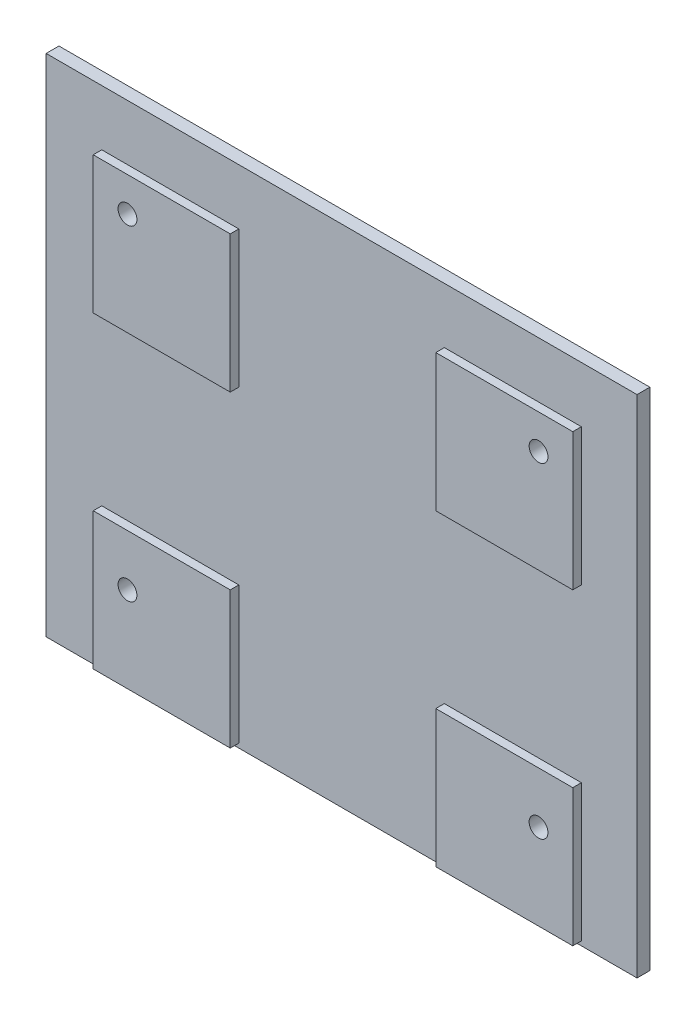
ISO-10303-21;
HEADER;
FILE_DESCRIPTION(('STEP AP214'),'2;1');
FILE_NAME('part.step','',(''),(''),'','','');
FILE_SCHEMA(('AUTOMOTIVE_DESIGN { 1 0 10303 214 1 1 1 1 }'));
ENDSEC;
DATA;
#1=APPLICATION_CONTEXT('core data for automotive mechanical design processes');
#2=APPLICATION_PROTOCOL_DEFINITION('international standard','automotive_design',2000,#1);
#3=PRODUCT_CONTEXT('',#1,'mechanical');
#4=PRODUCT('Part','Part','',(#3));
#5=PRODUCT_RELATED_PRODUCT_CATEGORY('part','',(#4));
#6=PRODUCT_DEFINITION_FORMATION('','',#4);
#7=PRODUCT_DEFINITION_CONTEXT('part definition',#1,'design');
#8=PRODUCT_DEFINITION('design','',#6,#7);
#9=PRODUCT_DEFINITION_SHAPE('','',#8);
#10=(LENGTH_UNIT() NAMED_UNIT(*) SI_UNIT(.MILLI.,.METRE.));
#11=(NAMED_UNIT(*) PLANE_ANGLE_UNIT() SI_UNIT($,.RADIAN.));
#12=(NAMED_UNIT(*) SI_UNIT($,.STERADIAN.) SOLID_ANGLE_UNIT());
#13=UNCERTAINTY_MEASURE_WITH_UNIT(LENGTH_MEASURE(1.E-05),#10,'distance_accuracy_value','');
#14=(GEOMETRIC_REPRESENTATION_CONTEXT(3) GLOBAL_UNCERTAINTY_ASSIGNED_CONTEXT((#13)) GLOBAL_UNIT_ASSIGNED_CONTEXT((#10,
#11,#12)) REPRESENTATION_CONTEXT('',''));
#15=CARTESIAN_POINT('',(0.,0.,0.));
#16=DIRECTION('',(0.,0.,1.));
#17=DIRECTION('',(1.,0.,0.));
#18=AXIS2_PLACEMENT_3D('',#15,#16,#17);
#19=CARTESIAN_POINT('',(345.,-295.000000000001,15.));
#20=DIRECTION('',(0.,0.,-1.));
#21=DIRECTION('',(-1.,0.,0.));
#22=AXIS2_PLACEMENT_3D('',#19,#20,#21);
#23=PLANE('',#22);
#24=DIRECTION('',(0.,-1.,0.));
#25=VECTOR('',#24,1.);
#26=CARTESIAN_POINT('',(120.,70.,15.));
#27=LINE('',#26,#25);
#28=CARTESIAN_POINT('',(120.,230.,15.));
#29=VERTEX_POINT('',#28);
#30=CARTESIAN_POINT('',(120.,70.,15.));
#31=VERTEX_POINT('',#30);
#32=EDGE_CURVE('E193',#29,#31,#27,.T.);
#33=ORIENTED_EDGE('',*,*,#32,.F.);
#34=DIRECTION('',(-1.,0.,0.));
#35=VECTOR('',#34,1.);
#36=CARTESIAN_POINT('',(120.,230.,15.));
#37=LINE('',#36,#35);
#38=CARTESIAN_POINT('',(280.,230.,15.));
#39=VERTEX_POINT('',#38);
#40=EDGE_CURVE('E206',#39,#29,#37,.T.);
#41=ORIENTED_EDGE('',*,*,#40,.F.);
#42=DIRECTION('',(0.,1.,0.));
#43=VECTOR('',#42,1.);
#44=CARTESIAN_POINT('',(280.,70.,15.));
#45=LINE('',#44,#43);
#46=CARTESIAN_POINT('',(280.,70.,15.));
#47=VERTEX_POINT('',#46);
#48=EDGE_CURVE('E215',#47,#39,#45,.T.);
#49=ORIENTED_EDGE('',*,*,#48,.F.);
#50=DIRECTION('',(1.,0.,0.));
#51=VECTOR('',#50,1.);
#52=CARTESIAN_POINT('',(120.,70.,15.));
#53=LINE('',#52,#51);
#54=EDGE_CURVE('E196',#31,#47,#53,.T.);
#55=ORIENTED_EDGE('',*,*,#54,.F.);
#56=EDGE_LOOP('',(#33,#41,#49,#55));
#57=FACE_BOUND('',#56,.T.);
#58=DIRECTION('',(0.,-1.,0.));
#59=VECTOR('',#58,1.);
#60=CARTESIAN_POINT('',(-280.,-290.,15.));
#61=LINE('',#60,#59);
#62=CARTESIAN_POINT('',(-280.,-130.,15.));
#63=VERTEX_POINT('',#62);
#64=CARTESIAN_POINT('',(-280.,-290.,15.));
#65=VERTEX_POINT('',#64);
#66=EDGE_CURVE('E264',#63,#65,#61,.T.);
#67=ORIENTED_EDGE('',*,*,#66,.F.);
#68=DIRECTION('',(-1.,0.,0.));
#69=VECTOR('',#68,1.);
#70=CARTESIAN_POINT('',(-280.,-130.,15.));
#71=LINE('',#70,#69);
#72=CARTESIAN_POINT('',(-120.,-130.,15.));
#73=VERTEX_POINT('',#72);
#74=EDGE_CURVE('E269',#73,#63,#71,.T.);
#75=ORIENTED_EDGE('',*,*,#74,.F.);
#76=DIRECTION('',(0.,1.,0.));
#77=VECTOR('',#76,1.);
#78=CARTESIAN_POINT('',(-120.,-290.,15.));
#79=LINE('',#78,#77);
#80=CARTESIAN_POINT('',(-120.,-290.,15.));
#81=VERTEX_POINT('',#80);
#82=EDGE_CURVE('E281',#81,#73,#79,.T.);
#83=ORIENTED_EDGE('',*,*,#82,.F.);
#84=DIRECTION('',(1.,0.,0.));
#85=VECTOR('',#84,1.);
#86=CARTESIAN_POINT('',(-280.,-290.,15.));
#87=LINE('',#86,#85);
#88=EDGE_CURVE('E278',#65,#81,#87,.T.);
#89=ORIENTED_EDGE('',*,*,#88,.F.);
#90=EDGE_LOOP('',(#67,#75,#83,#89));
#91=FACE_BOUND('',#90,.T.);
#92=DIRECTION('',(0.,1.,0.));
#93=VECTOR('',#92,1.);
#94=CARTESIAN_POINT('',(345.,295.000000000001,15.));
#95=LINE('',#94,#93);
#96=CARTESIAN_POINT('',(345.,-295.000000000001,15.));
#97=VERTEX_POINT('',#96);
#98=CARTESIAN_POINT('',(345.,295.000000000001,15.));
#99=VERTEX_POINT('',#98);
#100=EDGE_CURVE('E298',#97,#99,#95,.T.);
#101=ORIENTED_EDGE('',*,*,#100,.T.);
#102=DIRECTION('',(-1.,0.,0.));
#103=VECTOR('',#102,1.);
#104=CARTESIAN_POINT('',(-345.,295.000000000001,15.));
#105=LINE('',#104,#103);
#106=CARTESIAN_POINT('',(-345.,295.000000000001,15.));
#107=VERTEX_POINT('',#106);
#108=EDGE_CURVE('E301',#99,#107,#105,.T.);
#109=ORIENTED_EDGE('',*,*,#108,.T.);
#110=DIRECTION('',(0.,-1.,0.));
#111=VECTOR('',#110,1.);
#112=CARTESIAN_POINT('',(-345.,-295.000000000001,15.));
#113=LINE('',#112,#111);
#114=CARTESIAN_POINT('',(-345.,-295.000000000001,15.));
#115=VERTEX_POINT('',#114);
#116=EDGE_CURVE('E304',#107,#115,#113,.T.);
#117=ORIENTED_EDGE('',*,*,#116,.T.);
#118=DIRECTION('',(1.,0.,0.));
#119=VECTOR('',#118,1.);
#120=CARTESIAN_POINT('',(345.,-295.000000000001,15.));
#121=LINE('',#120,#119);
#122=EDGE_CURVE('E306',#115,#97,#121,.T.);
#123=ORIENTED_EDGE('',*,*,#122,.T.);
#124=EDGE_LOOP('',(#101,#109,#117,#123));
#125=FACE_BOUND('',#124,.T.);
#126=DIRECTION('',(0.,-1.,0.));
#127=VECTOR('',#126,1.);
#128=CARTESIAN_POINT('',(120.,-290.,15.));
#129=LINE('',#128,#127);
#130=CARTESIAN_POINT('',(120.,-130.,15.));
#131=VERTEX_POINT('',#130);
#132=CARTESIAN_POINT('',(120.,-290.,15.));
#133=VERTEX_POINT('',#132);
#134=EDGE_CURVE('E231',#131,#133,#129,.T.);
#135=ORIENTED_EDGE('',*,*,#134,.F.);
#136=DIRECTION('',(-1.,0.,0.));
#137=VECTOR('',#136,1.);
#138=CARTESIAN_POINT('',(120.,-130.,15.));
#139=LINE('',#138,#137);
#140=CARTESIAN_POINT('',(280.,-130.,15.));
#141=VERTEX_POINT('',#140);
#142=EDGE_CURVE('E236',#141,#131,#139,.T.);
#143=ORIENTED_EDGE('',*,*,#142,.F.);
#144=DIRECTION('',(0.,1.,0.));
#145=VECTOR('',#144,1.);
#146=CARTESIAN_POINT('',(280.,-290.,15.));
#147=LINE('',#146,#145);
#148=CARTESIAN_POINT('',(280.,-290.,15.));
#149=VERTEX_POINT('',#148);
#150=EDGE_CURVE('E248',#149,#141,#147,.T.);
#151=ORIENTED_EDGE('',*,*,#150,.F.);
#152=DIRECTION('',(1.,0.,0.));
#153=VECTOR('',#152,1.);
#154=CARTESIAN_POINT('',(120.,-290.,15.));
#155=LINE('',#154,#153);
#156=EDGE_CURVE('E245',#133,#149,#155,.T.);
#157=ORIENTED_EDGE('',*,*,#156,.F.);
#158=EDGE_LOOP('',(#135,#143,#151,#157));
#159=FACE_BOUND('',#158,.T.);
#160=DIRECTION('',(0.,-1.,0.));
#161=VECTOR('',#160,1.);
#162=CARTESIAN_POINT('',(-280.,69.9999999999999,15.));
#163=LINE('',#162,#161);
#164=CARTESIAN_POINT('',(-280.,230.,15.));
#165=VERTEX_POINT('',#164);
#166=CARTESIAN_POINT('',(-280.,70.,15.));
#167=VERTEX_POINT('',#166);
#168=EDGE_CURVE('E192',#165,#167,#163,.T.);
#169=ORIENTED_EDGE('',*,*,#168,.F.);
#170=DIRECTION('',(-1.,0.,0.));
#171=VECTOR('',#170,1.);
#172=CARTESIAN_POINT('',(-280.,230.,15.));
#173=LINE('',#172,#171);
#174=CARTESIAN_POINT('',(-120.,230.,15.));
#175=VERTEX_POINT('',#174);
#176=EDGE_CURVE('E189',#175,#165,#173,.T.);
#177=ORIENTED_EDGE('',*,*,#176,.F.);
#178=DIRECTION('',(0.,1.,0.));
#179=VECTOR('',#178,1.);
#180=CARTESIAN_POINT('',(-120.,69.9999999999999,15.));
#181=LINE('',#180,#179);
#182=CARTESIAN_POINT('',(-120.,69.9999999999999,15.));
#183=VERTEX_POINT('',#182);
#184=EDGE_CURVE('E55',#183,#175,#181,.T.);
#185=ORIENTED_EDGE('',*,*,#184,.F.);
#186=DIRECTION('',(1.,0.,0.));
#187=VECTOR('',#186,1.);
#188=CARTESIAN_POINT('',(-280.,69.9999999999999,15.));
#189=LINE('',#188,#187);
#190=EDGE_CURVE('E50',#167,#183,#189,.T.);
#191=ORIENTED_EDGE('',*,*,#190,.F.);
#192=EDGE_LOOP('',(#169,#177,#185,#191));
#193=FACE_BOUND('',#192,.T.);
#194=ADVANCED_FACE('F35',(#57,#91,#125,#159,#193),#23,.F.);
#195=CARTESIAN_POINT('',(345.,295.000000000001,15.));
#196=DIRECTION('',(-1.,0.,0.));
#197=DIRECTION('',(0.,-1.,0.));
#198=AXIS2_PLACEMENT_3D('',#195,#196,#197);
#199=PLANE('',#198);
#200=DIRECTION('',(0.,1.,0.));
#201=VECTOR('',#200,1.);
#202=CARTESIAN_POINT('',(345.,295.000000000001,0.));
#203=LINE('',#202,#201);
#204=CARTESIAN_POINT('',(345.,-295.000000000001,0.));
#205=VERTEX_POINT('',#204);
#206=CARTESIAN_POINT('',(345.,295.000000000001,0.));
#207=VERTEX_POINT('',#206);
#208=EDGE_CURVE('E297',#205,#207,#203,.T.);
#209=ORIENTED_EDGE('',*,*,#208,.T.);
#210=DIRECTION('',(0.,0.,-1.));
#211=VECTOR('',#210,1.);
#212=CARTESIAN_POINT('',(345.,295.000000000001,15.));
#213=LINE('',#212,#211);
#214=EDGE_CURVE('E11',#99,#207,#213,.T.);
#215=ORIENTED_EDGE('',*,*,#214,.F.);
#216=ORIENTED_EDGE('',*,*,#100,.F.);
#217=DIRECTION('',(0.,0.,-1.));
#218=VECTOR('',#217,1.);
#219=CARTESIAN_POINT('',(345.,-295.000000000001,15.));
#220=LINE('',#219,#218);
#221=EDGE_CURVE('E308',#97,#205,#220,.T.);
#222=ORIENTED_EDGE('',*,*,#221,.T.);
#223=EDGE_LOOP('',(#209,#215,#216,#222));
#224=FACE_BOUND('',#223,.T.);
#225=ADVANCED_FACE('F37',(#224),#199,.F.);
#226=CARTESIAN_POINT('',(-345.,295.000000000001,15.));
#227=DIRECTION('',(0.,-1.,0.));
#228=DIRECTION('',(0.,0.,-1.));
#229=AXIS2_PLACEMENT_3D('',#226,#227,#228);
#230=PLANE('',#229);
#231=DIRECTION('',(-1.,0.,0.));
#232=VECTOR('',#231,1.);
#233=CARTESIAN_POINT('',(-345.,295.000000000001,0.));
#234=LINE('',#233,#232);
#235=CARTESIAN_POINT('',(-345.,295.000000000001,0.));
#236=VERTEX_POINT('',#235);
#237=EDGE_CURVE('E311',#207,#236,#234,.T.);
#238=ORIENTED_EDGE('',*,*,#237,.T.);
#239=DIRECTION('',(0.,0.,-1.));
#240=VECTOR('',#239,1.);
#241=CARTESIAN_POINT('',(-345.,295.000000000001,15.));
#242=LINE('',#241,#240);
#243=EDGE_CURVE('E43',#107,#236,#242,.T.);
#244=ORIENTED_EDGE('',*,*,#243,.F.);
#245=ORIENTED_EDGE('',*,*,#108,.F.);
#246=ORIENTED_EDGE('',*,*,#214,.T.);
#247=EDGE_LOOP('',(#238,#244,#245,#246));
#248=FACE_BOUND('',#247,.T.);
#249=ADVANCED_FACE('F341',(#248),#230,.F.);
#250=CARTESIAN_POINT('',(-345.,-295.000000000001,15.));
#251=DIRECTION('',(1.,0.,0.));
#252=DIRECTION('',(0.,0.,-1.));
#253=AXIS2_PLACEMENT_3D('',#250,#251,#252);
#254=PLANE('',#253);
#255=DIRECTION('',(0.,-1.,0.));
#256=VECTOR('',#255,1.);
#257=CARTESIAN_POINT('',(-345.,-295.000000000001,0.));
#258=LINE('',#257,#256);
#259=CARTESIAN_POINT('',(-345.,-295.000000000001,0.));
#260=VERTEX_POINT('',#259);
#261=EDGE_CURVE('E313',#236,#260,#258,.T.);
#262=ORIENTED_EDGE('',*,*,#261,.T.);
#263=DIRECTION('',(0.,0.,-1.));
#264=VECTOR('',#263,1.);
#265=CARTESIAN_POINT('',(-345.,-295.000000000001,15.));
#266=LINE('',#265,#264);
#267=EDGE_CURVE('E318',#115,#260,#266,.T.);
#268=ORIENTED_EDGE('',*,*,#267,.F.);
#269=ORIENTED_EDGE('',*,*,#116,.F.);
#270=ORIENTED_EDGE('',*,*,#243,.T.);
#271=EDGE_LOOP('',(#262,#268,#269,#270));
#272=FACE_BOUND('',#271,.T.);
#273=ADVANCED_FACE('F325',(#272),#254,.F.);
#274=CARTESIAN_POINT('',(345.,-295.000000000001,15.));
#275=DIRECTION('',(0.,1.,0.));
#276=DIRECTION('',(-1.,0.,0.));
#277=AXIS2_PLACEMENT_3D('',#274,#275,#276);
#278=PLANE('',#277);
#279=DIRECTION('',(1.,0.,0.));
#280=VECTOR('',#279,1.);
#281=CARTESIAN_POINT('',(345.,-295.000000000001,0.));
#282=LINE('',#281,#280);
#283=EDGE_CURVE('E302',#260,#205,#282,.T.);
#284=ORIENTED_EDGE('',*,*,#283,.T.);
#285=ORIENTED_EDGE('',*,*,#221,.F.);
#286=ORIENTED_EDGE('',*,*,#122,.F.);
#287=ORIENTED_EDGE('',*,*,#267,.T.);
#288=EDGE_LOOP('',(#284,#285,#286,#287));
#289=FACE_BOUND('',#288,.T.);
#290=ADVANCED_FACE('F334',(#289),#278,.F.);
#291=CARTESIAN_POINT('',(345.,-295.000000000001,0.));
#292=DIRECTION('',(0.,0.,-1.));
#293=DIRECTION('',(-1.,0.,0.));
#294=AXIS2_PLACEMENT_3D('',#291,#292,#293);
#295=PLANE('',#294);
#296=CARTESIAN_POINT('',(-240.,-190.,0.));
#297=DIRECTION('',(0.,0.,-1.));
#298=DIRECTION('',(-1.,0.,0.));
#299=AXIS2_PLACEMENT_3D('',#296,#297,#298);
#300=CIRCLE('',#299,11.);
#301=CARTESIAN_POINT('',(-251.,-190.,0.));
#302=VERTEX_POINT('',#301);
#303=EDGE_CURVE('E629',#302,#302,#300,.F.);
#304=ORIENTED_EDGE('',*,*,#303,.T.);
#305=EDGE_LOOP('',(#304));
#306=FACE_BOUND('',#305,.T.);
#307=CARTESIAN_POINT('',(240.,-190.,0.));
#308=DIRECTION('',(0.,0.,-1.));
#309=DIRECTION('',(-1.,0.,0.));
#310=AXIS2_PLACEMENT_3D('',#307,#308,#309);
#311=CIRCLE('',#310,11.);
#312=CARTESIAN_POINT('',(229.,-190.,0.));
#313=VERTEX_POINT('',#312);
#314=EDGE_CURVE('E633',#313,#313,#311,.F.);
#315=ORIENTED_EDGE('',*,*,#314,.T.);
#316=EDGE_LOOP('',(#315));
#317=FACE_BOUND('',#316,.T.);
#318=CARTESIAN_POINT('',(240.,190.,0.));
#319=DIRECTION('',(0.,0.,-1.));
#320=DIRECTION('',(-1.,0.,0.));
#321=AXIS2_PLACEMENT_3D('',#318,#319,#320);
#322=CIRCLE('',#321,11.);
#323=CARTESIAN_POINT('',(229.,190.,0.));
#324=VERTEX_POINT('',#323);
#325=EDGE_CURVE('E641',#324,#324,#322,.F.);
#326=ORIENTED_EDGE('',*,*,#325,.T.);
#327=EDGE_LOOP('',(#326));
#328=FACE_BOUND('',#327,.T.);
#329=CARTESIAN_POINT('',(-240.,190.,0.));
#330=DIRECTION('',(0.,0.,-1.));
#331=DIRECTION('',(-1.,0.,0.));
#332=AXIS2_PLACEMENT_3D('',#329,#330,#331);
#333=CIRCLE('',#332,11.);
#334=CARTESIAN_POINT('',(-251.,190.,0.));
#335=VERTEX_POINT('',#334);
#336=EDGE_CURVE('E646',#335,#335,#333,.F.);
#337=ORIENTED_EDGE('',*,*,#336,.T.);
#338=EDGE_LOOP('',(#337));
#339=FACE_BOUND('',#338,.T.);
#340=ORIENTED_EDGE('',*,*,#208,.F.);
#341=ORIENTED_EDGE('',*,*,#283,.F.);
#342=ORIENTED_EDGE('',*,*,#261,.F.);
#343=ORIENTED_EDGE('',*,*,#237,.F.);
#344=EDGE_LOOP('',(#340,#341,#342,#343));
#345=FACE_BOUND('',#344,.T.);
#346=ADVANCED_FACE('F331',(#306,#317,#328,#339,#345),#295,.T.);
#347=CARTESIAN_POINT('',(-280.,-290.,25.));
#348=DIRECTION('',(1.,0.,0.));
#349=DIRECTION('',(0.,0.,-1.));
#350=AXIS2_PLACEMENT_3D('',#347,#348,#349);
#351=PLANE('',#350);
#352=ORIENTED_EDGE('',*,*,#66,.T.);
#353=DIRECTION('',(0.,0.,-1.));
#354=VECTOR('',#353,1.);
#355=CARTESIAN_POINT('',(-280.,-290.,25.));
#356=LINE('',#355,#354);
#357=CARTESIAN_POINT('',(-280.,-290.,25.));
#358=VERTEX_POINT('',#357);
#359=EDGE_CURVE('E294',#358,#65,#356,.T.);
#360=ORIENTED_EDGE('',*,*,#359,.F.);
#361=DIRECTION('',(0.,-1.,0.));
#362=VECTOR('',#361,1.);
#363=CARTESIAN_POINT('',(-280.,-290.,25.));
#364=LINE('',#363,#362);
#365=CARTESIAN_POINT('',(-280.,-130.,25.));
#366=VERTEX_POINT('',#365);
#367=EDGE_CURVE('E265',#366,#358,#364,.T.);
#368=ORIENTED_EDGE('',*,*,#367,.F.);
#369=DIRECTION('',(0.,0.,-1.));
#370=VECTOR('',#369,1.);
#371=CARTESIAN_POINT('',(-280.,-130.,25.));
#372=LINE('',#371,#370);
#373=EDGE_CURVE('E275',#366,#63,#372,.T.);
#374=ORIENTED_EDGE('',*,*,#373,.T.);
#375=EDGE_LOOP('',(#352,#360,#368,#374));
#376=FACE_BOUND('',#375,.T.);
#377=ADVANCED_FACE('F356',(#376),#351,.F.);
#378=CARTESIAN_POINT('',(-280.,-290.,25.));
#379=DIRECTION('',(0.,1.,0.));
#380=DIRECTION('',(0.,0.,1.));
#381=AXIS2_PLACEMENT_3D('',#378,#379,#380);
#382=PLANE('',#381);
#383=ORIENTED_EDGE('',*,*,#88,.T.);
#384=DIRECTION('',(0.,0.,-1.));
#385=VECTOR('',#384,1.);
#386=CARTESIAN_POINT('',(-120.,-290.,25.));
#387=LINE('',#386,#385);
#388=CARTESIAN_POINT('',(-120.,-290.,25.));
#389=VERTEX_POINT('',#388);
#390=EDGE_CURVE('E291',#389,#81,#387,.T.);
#391=ORIENTED_EDGE('',*,*,#390,.F.);
#392=DIRECTION('',(1.,0.,0.));
#393=VECTOR('',#392,1.);
#394=CARTESIAN_POINT('',(-280.,-290.,25.));
#395=LINE('',#394,#393);
#396=EDGE_CURVE('E268',#358,#389,#395,.T.);
#397=ORIENTED_EDGE('',*,*,#396,.F.);
#398=ORIENTED_EDGE('',*,*,#359,.T.);
#399=EDGE_LOOP('',(#383,#391,#397,#398));
#400=FACE_BOUND('',#399,.T.);
#401=ADVANCED_FACE('F378',(#400),#382,.F.);
#402=CARTESIAN_POINT('',(-120.,-290.,25.));
#403=DIRECTION('',(-1.,0.,0.));
#404=DIRECTION('',(0.,0.,1.));
#405=AXIS2_PLACEMENT_3D('',#402,#403,#404);
#406=PLANE('',#405);
#407=ORIENTED_EDGE('',*,*,#82,.T.);
#408=DIRECTION('',(0.,0.,-1.));
#409=VECTOR('',#408,1.);
#410=CARTESIAN_POINT('',(-120.,-130.,25.));
#411=LINE('',#410,#409);
#412=CARTESIAN_POINT('',(-120.,-130.,25.));
#413=VERTEX_POINT('',#412);
#414=EDGE_CURVE('E288',#413,#73,#411,.T.);
#415=ORIENTED_EDGE('',*,*,#414,.F.);
#416=DIRECTION('',(0.,1.,0.));
#417=VECTOR('',#416,1.);
#418=CARTESIAN_POINT('',(-120.,-290.,25.));
#419=LINE('',#418,#417);
#420=EDGE_CURVE('E271',#389,#413,#419,.T.);
#421=ORIENTED_EDGE('',*,*,#420,.F.);
#422=ORIENTED_EDGE('',*,*,#390,.T.);
#423=EDGE_LOOP('',(#407,#415,#421,#422));
#424=FACE_BOUND('',#423,.T.);
#425=ADVANCED_FACE('F385',(#424),#406,.F.);
#426=CARTESIAN_POINT('',(-280.,-130.,25.));
#427=DIRECTION('',(0.,-1.,0.));
#428=DIRECTION('',(0.,0.,-1.));
#429=AXIS2_PLACEMENT_3D('',#426,#427,#428);
#430=PLANE('',#429);
#431=ORIENTED_EDGE('',*,*,#74,.T.);
#432=ORIENTED_EDGE('',*,*,#373,.F.);
#433=DIRECTION('',(-1.,0.,0.));
#434=VECTOR('',#433,1.);
#435=CARTESIAN_POINT('',(-280.,-130.,25.));
#436=LINE('',#435,#434);
#437=EDGE_CURVE('E273',#413,#366,#436,.T.);
#438=ORIENTED_EDGE('',*,*,#437,.F.);
#439=ORIENTED_EDGE('',*,*,#414,.T.);
#440=EDGE_LOOP('',(#431,#432,#438,#439));
#441=FACE_BOUND('',#440,.T.);
#442=ADVANCED_FACE('F392',(#441),#430,.F.);
#443=CARTESIAN_POINT('',(-280.,-130.,25.));
#444=DIRECTION('',(0.,0.,-1.));
#445=DIRECTION('',(-1.,0.,0.));
#446=AXIS2_PLACEMENT_3D('',#443,#444,#445);
#447=PLANE('',#446);
#448=CARTESIAN_POINT('',(-240.,-190.,25.));
#449=DIRECTION('',(0.,0.,1.));
#450=DIRECTION('',(1.,0.,0.));
#451=AXIS2_PLACEMENT_3D('',#448,#449,#450);
#452=CIRCLE('',#451,11.);
#453=CARTESIAN_POINT('',(-229.,-190.,25.));
#454=VERTEX_POINT('',#453);
#455=EDGE_CURVE('E632',#454,#454,#452,.T.);
#456=ORIENTED_EDGE('',*,*,#455,.F.);
#457=EDGE_LOOP('',(#456));
#458=FACE_BOUND('',#457,.T.);
#459=ORIENTED_EDGE('',*,*,#367,.T.);
#460=ORIENTED_EDGE('',*,*,#396,.T.);
#461=ORIENTED_EDGE('',*,*,#420,.T.);
#462=ORIENTED_EDGE('',*,*,#437,.T.);
#463=EDGE_LOOP('',(#459,#460,#461,#462));
#464=FACE_BOUND('',#463,.T.);
#465=ADVANCED_FACE('F400',(#458,#464),#447,.F.);
#466=CARTESIAN_POINT('',(120.,-290.,25.));
#467=DIRECTION('',(1.,0.,0.));
#468=DIRECTION('',(0.,0.,-1.));
#469=AXIS2_PLACEMENT_3D('',#466,#467,#468);
#470=PLANE('',#469);
#471=ORIENTED_EDGE('',*,*,#134,.T.);
#472=DIRECTION('',(0.,0.,-1.));
#473=VECTOR('',#472,1.);
#474=CARTESIAN_POINT('',(120.,-290.,25.));
#475=LINE('',#474,#473);
#476=CARTESIAN_POINT('',(120.,-290.,25.));
#477=VERTEX_POINT('',#476);
#478=EDGE_CURVE('E261',#477,#133,#475,.T.);
#479=ORIENTED_EDGE('',*,*,#478,.F.);
#480=DIRECTION('',(0.,-1.,0.));
#481=VECTOR('',#480,1.);
#482=CARTESIAN_POINT('',(120.,-290.,25.));
#483=LINE('',#482,#481);
#484=CARTESIAN_POINT('',(120.,-130.,25.));
#485=VERTEX_POINT('',#484);
#486=EDGE_CURVE('E232',#485,#477,#483,.T.);
#487=ORIENTED_EDGE('',*,*,#486,.F.);
#488=DIRECTION('',(0.,0.,-1.));
#489=VECTOR('',#488,1.);
#490=CARTESIAN_POINT('',(120.,-130.,25.));
#491=LINE('',#490,#489);
#492=EDGE_CURVE('E242',#485,#131,#491,.T.);
#493=ORIENTED_EDGE('',*,*,#492,.T.);
#494=EDGE_LOOP('',(#471,#479,#487,#493));
#495=FACE_BOUND('',#494,.T.);
#496=ADVANCED_FACE('F408',(#495),#470,.F.);
#497=CARTESIAN_POINT('',(120.,-290.,25.));
#498=DIRECTION('',(0.,1.,0.));
#499=DIRECTION('',(0.,0.,1.));
#500=AXIS2_PLACEMENT_3D('',#497,#498,#499);
#501=PLANE('',#500);
#502=ORIENTED_EDGE('',*,*,#156,.T.);
#503=DIRECTION('',(0.,0.,-1.));
#504=VECTOR('',#503,1.);
#505=CARTESIAN_POINT('',(280.,-290.,25.));
#506=LINE('',#505,#504);
#507=CARTESIAN_POINT('',(280.,-290.,25.));
#508=VERTEX_POINT('',#507);
#509=EDGE_CURVE('E258',#508,#149,#506,.T.);
#510=ORIENTED_EDGE('',*,*,#509,.F.);
#511=DIRECTION('',(1.,0.,0.));
#512=VECTOR('',#511,1.);
#513=CARTESIAN_POINT('',(120.,-290.,25.));
#514=LINE('',#513,#512);
#515=EDGE_CURVE('E235',#477,#508,#514,.T.);
#516=ORIENTED_EDGE('',*,*,#515,.F.);
#517=ORIENTED_EDGE('',*,*,#478,.T.);
#518=EDGE_LOOP('',(#502,#510,#516,#517));
#519=FACE_BOUND('',#518,.T.);
#520=ADVANCED_FACE('F416',(#519),#501,.F.);
#521=CARTESIAN_POINT('',(280.,-290.,25.));
#522=DIRECTION('',(-1.,0.,0.));
#523=DIRECTION('',(0.,0.,1.));
#524=AXIS2_PLACEMENT_3D('',#521,#522,#523);
#525=PLANE('',#524);
#526=ORIENTED_EDGE('',*,*,#150,.T.);
#527=DIRECTION('',(0.,0.,-1.));
#528=VECTOR('',#527,1.);
#529=CARTESIAN_POINT('',(280.,-130.,25.));
#530=LINE('',#529,#528);
#531=CARTESIAN_POINT('',(280.,-130.,25.));
#532=VERTEX_POINT('',#531);
#533=EDGE_CURVE('E255',#532,#141,#530,.T.);
#534=ORIENTED_EDGE('',*,*,#533,.F.);
#535=DIRECTION('',(0.,1.,0.));
#536=VECTOR('',#535,1.);
#537=CARTESIAN_POINT('',(280.,-290.,25.));
#538=LINE('',#537,#536);
#539=EDGE_CURVE('E238',#508,#532,#538,.T.);
#540=ORIENTED_EDGE('',*,*,#539,.F.);
#541=ORIENTED_EDGE('',*,*,#509,.T.);
#542=EDGE_LOOP('',(#526,#534,#540,#541));
#543=FACE_BOUND('',#542,.T.);
#544=ADVANCED_FACE('F424',(#543),#525,.F.);
#545=CARTESIAN_POINT('',(120.,-130.,25.));
#546=DIRECTION('',(0.,-1.,0.));
#547=DIRECTION('',(0.,0.,-1.));
#548=AXIS2_PLACEMENT_3D('',#545,#546,#547);
#549=PLANE('',#548);
#550=ORIENTED_EDGE('',*,*,#142,.T.);
#551=ORIENTED_EDGE('',*,*,#492,.F.);
#552=DIRECTION('',(-1.,0.,0.));
#553=VECTOR('',#552,1.);
#554=CARTESIAN_POINT('',(120.,-130.,25.));
#555=LINE('',#554,#553);
#556=EDGE_CURVE('E240',#532,#485,#555,.T.);
#557=ORIENTED_EDGE('',*,*,#556,.F.);
#558=ORIENTED_EDGE('',*,*,#533,.T.);
#559=EDGE_LOOP('',(#550,#551,#557,#558));
#560=FACE_BOUND('',#559,.T.);
#561=ADVANCED_FACE('F432',(#560),#549,.F.);
#562=CARTESIAN_POINT('',(120.,-130.,25.));
#563=DIRECTION('',(0.,0.,-1.));
#564=DIRECTION('',(-1.,0.,0.));
#565=AXIS2_PLACEMENT_3D('',#562,#563,#564);
#566=PLANE('',#565);
#567=CARTESIAN_POINT('',(240.,-190.,25.));
#568=DIRECTION('',(0.,0.,1.));
#569=DIRECTION('',(1.,0.,0.));
#570=AXIS2_PLACEMENT_3D('',#567,#568,#569);
#571=CIRCLE('',#570,11.);
#572=CARTESIAN_POINT('',(251.,-190.,25.));
#573=VERTEX_POINT('',#572);
#574=EDGE_CURVE('E636',#573,#573,#571,.T.);
#575=ORIENTED_EDGE('',*,*,#574,.F.);
#576=EDGE_LOOP('',(#575));
#577=FACE_BOUND('',#576,.T.);
#578=ORIENTED_EDGE('',*,*,#486,.T.);
#579=ORIENTED_EDGE('',*,*,#515,.T.);
#580=ORIENTED_EDGE('',*,*,#539,.T.);
#581=ORIENTED_EDGE('',*,*,#556,.T.);
#582=EDGE_LOOP('',(#578,#579,#580,#581));
#583=FACE_BOUND('',#582,.T.);
#584=ADVANCED_FACE('F440',(#577,#583),#566,.F.);
#585=CARTESIAN_POINT('',(120.,70.,25.));
#586=DIRECTION('',(1.,0.,0.));
#587=DIRECTION('',(0.,0.,-1.));
#588=AXIS2_PLACEMENT_3D('',#585,#586,#587);
#589=PLANE('',#588);
#590=ORIENTED_EDGE('',*,*,#32,.T.);
#591=DIRECTION('',(0.,0.,-1.));
#592=VECTOR('',#591,1.);
#593=CARTESIAN_POINT('',(120.,70.,25.));
#594=LINE('',#593,#592);
#595=CARTESIAN_POINT('',(120.,70.,25.));
#596=VERTEX_POINT('',#595);
#597=EDGE_CURVE('E228',#596,#31,#594,.T.);
#598=ORIENTED_EDGE('',*,*,#597,.F.);
#599=DIRECTION('',(0.,-1.,0.));
#600=VECTOR('',#599,1.);
#601=CARTESIAN_POINT('',(120.,70.,25.));
#602=LINE('',#601,#600);
#603=CARTESIAN_POINT('',(120.,230.,25.));
#604=VERTEX_POINT('',#603);
#605=EDGE_CURVE('E202',#604,#596,#602,.T.);
#606=ORIENTED_EDGE('',*,*,#605,.F.);
#607=DIRECTION('',(0.,0.,-1.));
#608=VECTOR('',#607,1.);
#609=CARTESIAN_POINT('',(120.,230.,25.));
#610=LINE('',#609,#608);
#611=EDGE_CURVE('E211',#604,#29,#610,.T.);
#612=ORIENTED_EDGE('',*,*,#611,.T.);
#613=EDGE_LOOP('',(#590,#598,#606,#612));
#614=FACE_BOUND('',#613,.T.);
#615=ADVANCED_FACE('F448',(#614),#589,.F.);
#616=CARTESIAN_POINT('',(120.,70.,25.));
#617=DIRECTION('',(0.,1.,0.));
#618=DIRECTION('',(0.,0.,1.));
#619=AXIS2_PLACEMENT_3D('',#616,#617,#618);
#620=PLANE('',#619);
#621=ORIENTED_EDGE('',*,*,#54,.T.);
#622=DIRECTION('',(0.,0.,-1.));
#623=VECTOR('',#622,1.);
#624=CARTESIAN_POINT('',(280.,70.,25.));
#625=LINE('',#624,#623);
#626=CARTESIAN_POINT('',(280.,70.,25.));
#627=VERTEX_POINT('',#626);
#628=EDGE_CURVE('E225',#627,#47,#625,.T.);
#629=ORIENTED_EDGE('',*,*,#628,.F.);
#630=DIRECTION('',(1.,0.,0.));
#631=VECTOR('',#630,1.);
#632=CARTESIAN_POINT('',(120.,70.,25.));
#633=LINE('',#632,#631);
#634=EDGE_CURVE('E205',#596,#627,#633,.T.);
#635=ORIENTED_EDGE('',*,*,#634,.F.);
#636=ORIENTED_EDGE('',*,*,#597,.T.);
#637=EDGE_LOOP('',(#621,#629,#635,#636));
#638=FACE_BOUND('',#637,.T.);
#639=ADVANCED_FACE('F456',(#638),#620,.F.);
#640=CARTESIAN_POINT('',(280.,70.,25.));
#641=DIRECTION('',(-1.,0.,0.));
#642=DIRECTION('',(0.,0.,1.));
#643=AXIS2_PLACEMENT_3D('',#640,#641,#642);
#644=PLANE('',#643);
#645=ORIENTED_EDGE('',*,*,#48,.T.);
#646=DIRECTION('',(0.,0.,-1.));
#647=VECTOR('',#646,1.);
#648=CARTESIAN_POINT('',(280.,230.,25.));
#649=LINE('',#648,#647);
#650=CARTESIAN_POINT('',(280.,230.,25.));
#651=VERTEX_POINT('',#650);
#652=EDGE_CURVE('E222',#651,#39,#649,.T.);
#653=ORIENTED_EDGE('',*,*,#652,.F.);
#654=DIRECTION('',(0.,1.,0.));
#655=VECTOR('',#654,1.);
#656=CARTESIAN_POINT('',(280.,70.,25.));
#657=LINE('',#656,#655);
#658=EDGE_CURVE('E208',#627,#651,#657,.T.);
#659=ORIENTED_EDGE('',*,*,#658,.F.);
#660=ORIENTED_EDGE('',*,*,#628,.T.);
#661=EDGE_LOOP('',(#645,#653,#659,#660));
#662=FACE_BOUND('',#661,.T.);
#663=ADVANCED_FACE('F464',(#662),#644,.F.);
#664=CARTESIAN_POINT('',(120.,230.,25.));
#665=DIRECTION('',(0.,-1.,0.));
#666=DIRECTION('',(0.,0.,-1.));
#667=AXIS2_PLACEMENT_3D('',#664,#665,#666);
#668=PLANE('',#667);
#669=ORIENTED_EDGE('',*,*,#40,.T.);
#670=ORIENTED_EDGE('',*,*,#611,.F.);
#671=DIRECTION('',(-1.,0.,0.));
#672=VECTOR('',#671,1.);
#673=CARTESIAN_POINT('',(120.,230.,25.));
#674=LINE('',#673,#672);
#675=EDGE_CURVE('E210',#651,#604,#674,.T.);
#676=ORIENTED_EDGE('',*,*,#675,.F.);
#677=ORIENTED_EDGE('',*,*,#652,.T.);
#678=EDGE_LOOP('',(#669,#670,#676,#677));
#679=FACE_BOUND('',#678,.T.);
#680=ADVANCED_FACE('F472',(#679),#668,.F.);
#681=CARTESIAN_POINT('',(120.,230.,25.));
#682=DIRECTION('',(0.,0.,-1.));
#683=DIRECTION('',(-1.,0.,0.));
#684=AXIS2_PLACEMENT_3D('',#681,#682,#683);
#685=PLANE('',#684);
#686=CARTESIAN_POINT('',(240.,190.,25.));
#687=DIRECTION('',(0.,0.,1.));
#688=DIRECTION('',(1.,0.,0.));
#689=AXIS2_PLACEMENT_3D('',#686,#687,#688);
#690=CIRCLE('',#689,11.);
#691=CARTESIAN_POINT('',(251.,190.,25.));
#692=VERTEX_POINT('',#691);
#693=EDGE_CURVE('E643',#692,#692,#690,.T.);
#694=ORIENTED_EDGE('',*,*,#693,.F.);
#695=EDGE_LOOP('',(#694));
#696=FACE_BOUND('',#695,.T.);
#697=ORIENTED_EDGE('',*,*,#605,.T.);
#698=ORIENTED_EDGE('',*,*,#634,.T.);
#699=ORIENTED_EDGE('',*,*,#658,.T.);
#700=ORIENTED_EDGE('',*,*,#675,.T.);
#701=EDGE_LOOP('',(#697,#698,#699,#700));
#702=FACE_BOUND('',#701,.T.);
#703=ADVANCED_FACE('F480',(#696,#702),#685,.F.);
#704=CARTESIAN_POINT('',(-280.,69.9999999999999,25.));
#705=DIRECTION('',(1.,0.,0.));
#706=DIRECTION('',(0.,0.,-1.));
#707=AXIS2_PLACEMENT_3D('',#704,#705,#706);
#708=PLANE('',#707);
#709=ORIENTED_EDGE('',*,*,#168,.T.);
#710=DIRECTION('',(0.,0.,-1.));
#711=VECTOR('',#710,1.);
#712=CARTESIAN_POINT('',(-280.,69.9999999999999,25.));
#713=LINE('',#712,#711);
#714=CARTESIAN_POINT('',(-280.,69.9999999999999,25.));
#715=VERTEX_POINT('',#714);
#716=EDGE_CURVE('E173',#715,#167,#713,.T.);
#717=ORIENTED_EDGE('',*,*,#716,.F.);
#718=DIRECTION('',(0.,-1.,0.));
#719=VECTOR('',#718,1.);
#720=CARTESIAN_POINT('',(-280.,69.9999999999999,25.));
#721=LINE('',#720,#719);
#722=CARTESIAN_POINT('',(-280.,230.,25.));
#723=VERTEX_POINT('',#722);
#724=EDGE_CURVE('E180',#723,#715,#721,.T.);
#725=ORIENTED_EDGE('',*,*,#724,.F.);
#726=DIRECTION('',(0.,0.,-1.));
#727=VECTOR('',#726,1.);
#728=CARTESIAN_POINT('',(-280.,230.,25.));
#729=LINE('',#728,#727);
#730=EDGE_CURVE('E656',#723,#165,#729,.T.);
#731=ORIENTED_EDGE('',*,*,#730,.T.);
#732=EDGE_LOOP('',(#709,#717,#725,#731));
#733=FACE_BOUND('',#732,.T.);
#734=ADVANCED_FACE('F191',(#733),#708,.F.);
#735=CARTESIAN_POINT('',(-280.,69.9999999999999,25.));
#736=DIRECTION('',(0.,1.,0.));
#737=DIRECTION('',(-1.,0.,0.));
#738=AXIS2_PLACEMENT_3D('',#735,#736,#737);
#739=PLANE('',#738);
#740=ORIENTED_EDGE('',*,*,#190,.T.);
#741=DIRECTION('',(0.,0.,-1.));
#742=VECTOR('',#741,1.);
#743=CARTESIAN_POINT('',(-120.,69.9999999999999,25.));
#744=LINE('',#743,#742);
#745=CARTESIAN_POINT('',(-120.,69.9999999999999,25.));
#746=VERTEX_POINT('',#745);
#747=EDGE_CURVE('E176',#746,#183,#744,.T.);
#748=ORIENTED_EDGE('',*,*,#747,.F.);
#749=DIRECTION('',(1.,0.,0.));
#750=VECTOR('',#749,1.);
#751=CARTESIAN_POINT('',(-280.,69.9999999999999,25.));
#752=LINE('',#751,#750);
#753=EDGE_CURVE('E169',#715,#746,#752,.T.);
#754=ORIENTED_EDGE('',*,*,#753,.F.);
#755=ORIENTED_EDGE('',*,*,#716,.T.);
#756=EDGE_LOOP('',(#740,#748,#754,#755));
#757=FACE_BOUND('',#756,.T.);
#758=ADVANCED_FACE('F171',(#757),#739,.F.);
#759=CARTESIAN_POINT('',(-120.,69.9999999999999,25.));
#760=DIRECTION('',(-1.,0.,0.));
#761=DIRECTION('',(0.,0.,1.));
#762=AXIS2_PLACEMENT_3D('',#759,#760,#761);
#763=PLANE('',#762);
#764=ORIENTED_EDGE('',*,*,#184,.T.);
#765=DIRECTION('',(0.,0.,-1.));
#766=VECTOR('',#765,1.);
#767=CARTESIAN_POINT('',(-120.,230.,25.));
#768=LINE('',#767,#766);
#769=CARTESIAN_POINT('',(-120.,230.,25.));
#770=VERTEX_POINT('',#769);
#771=EDGE_CURVE('E198',#770,#175,#768,.T.);
#772=ORIENTED_EDGE('',*,*,#771,.F.);
#773=DIRECTION('',(0.,1.,0.));
#774=VECTOR('',#773,1.);
#775=CARTESIAN_POINT('',(-120.,69.9999999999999,25.));
#776=LINE('',#775,#774);
#777=EDGE_CURVE('E179',#746,#770,#776,.T.);
#778=ORIENTED_EDGE('',*,*,#777,.F.);
#779=ORIENTED_EDGE('',*,*,#747,.T.);
#780=EDGE_LOOP('',(#764,#772,#778,#779));
#781=FACE_BOUND('',#780,.T.);
#782=ADVANCED_FACE('F501',(#781),#763,.F.);
#783=CARTESIAN_POINT('',(-280.,230.,25.));
#784=DIRECTION('',(0.,-1.,0.));
#785=DIRECTION('',(0.,0.,-1.));
#786=AXIS2_PLACEMENT_3D('',#783,#784,#785);
#787=PLANE('',#786);
#788=ORIENTED_EDGE('',*,*,#176,.T.);
#789=ORIENTED_EDGE('',*,*,#730,.F.);
#790=DIRECTION('',(-1.,0.,0.));
#791=VECTOR('',#790,1.);
#792=CARTESIAN_POINT('',(-280.,230.,25.));
#793=LINE('',#792,#791);
#794=EDGE_CURVE('E185',#770,#723,#793,.T.);
#795=ORIENTED_EDGE('',*,*,#794,.F.);
#796=ORIENTED_EDGE('',*,*,#771,.T.);
#797=EDGE_LOOP('',(#788,#789,#795,#796));
#798=FACE_BOUND('',#797,.T.);
#799=ADVANCED_FACE('F508',(#798),#787,.F.);
#800=CARTESIAN_POINT('',(-280.,230.,25.));
#801=DIRECTION('',(0.,0.,-1.));
#802=DIRECTION('',(-1.,0.,0.));
#803=AXIS2_PLACEMENT_3D('',#800,#801,#802);
#804=PLANE('',#803);
#805=CARTESIAN_POINT('',(-240.,190.,25.));
#806=DIRECTION('',(0.,0.,1.));
#807=DIRECTION('',(1.,0.,0.));
#808=AXIS2_PLACEMENT_3D('',#805,#806,#807);
#809=CIRCLE('',#808,11.);
#810=CARTESIAN_POINT('',(-229.,190.,25.));
#811=VERTEX_POINT('',#810);
#812=EDGE_CURVE('E649',#811,#811,#809,.T.);
#813=ORIENTED_EDGE('',*,*,#812,.F.);
#814=EDGE_LOOP('',(#813));
#815=FACE_BOUND('',#814,.T.);
#816=ORIENTED_EDGE('',*,*,#724,.T.);
#817=ORIENTED_EDGE('',*,*,#753,.T.);
#818=ORIENTED_EDGE('',*,*,#777,.T.);
#819=ORIENTED_EDGE('',*,*,#794,.T.);
#820=EDGE_LOOP('',(#816,#817,#818,#819));
#821=FACE_BOUND('',#820,.T.);
#822=ADVANCED_FACE('F183',(#815,#821),#804,.F.);
#823=CARTESIAN_POINT('',(-240.,190.,-0.001000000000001));
#824=DIRECTION('',(0.,0.,1.));
#825=DIRECTION('',(1.,0.,0.));
#826=AXIS2_PLACEMENT_3D('',#823,#824,#825);
#827=CYLINDRICAL_SURFACE('',#826,11.);
#828=ORIENTED_EDGE('',*,*,#336,.F.);
#829=EDGE_LOOP('',(#828));
#830=FACE_BOUND('',#829,.T.);
#831=ORIENTED_EDGE('',*,*,#812,.T.);
#832=EDGE_LOOP('',(#831));
#833=FACE_BOUND('',#832,.T.);
#834=ADVANCED_FACE('F521',(#830,#833),#827,.F.);
#835=CARTESIAN_POINT('',(240.,190.,-0.001000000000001));
#836=DIRECTION('',(0.,0.,1.));
#837=DIRECTION('',(1.,0.,0.));
#838=AXIS2_PLACEMENT_3D('',#835,#836,#837);
#839=CYLINDRICAL_SURFACE('',#838,11.);
#840=ORIENTED_EDGE('',*,*,#325,.F.);
#841=EDGE_LOOP('',(#840));
#842=FACE_BOUND('',#841,.T.);
#843=ORIENTED_EDGE('',*,*,#693,.T.);
#844=EDGE_LOOP('',(#843));
#845=FACE_BOUND('',#844,.T.);
#846=ADVANCED_FACE('F529',(#842,#845),#839,.F.);
#847=CARTESIAN_POINT('',(240.,-190.,-0.001000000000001));
#848=DIRECTION('',(0.,0.,1.));
#849=DIRECTION('',(1.,0.,0.));
#850=AXIS2_PLACEMENT_3D('',#847,#848,#849);
#851=CYLINDRICAL_SURFACE('',#850,11.);
#852=ORIENTED_EDGE('',*,*,#314,.F.);
#853=EDGE_LOOP('',(#852));
#854=FACE_BOUND('',#853,.T.);
#855=ORIENTED_EDGE('',*,*,#574,.T.);
#856=EDGE_LOOP('',(#855));
#857=FACE_BOUND('',#856,.T.);
#858=ADVANCED_FACE('F537',(#854,#857),#851,.F.);
#859=CARTESIAN_POINT('',(-240.,-190.,-0.001000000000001));
#860=DIRECTION('',(0.,0.,1.));
#861=DIRECTION('',(1.,0.,0.));
#862=AXIS2_PLACEMENT_3D('',#859,#860,#861);
#863=CYLINDRICAL_SURFACE('',#862,11.);
#864=ORIENTED_EDGE('',*,*,#303,.F.);
#865=EDGE_LOOP('',(#864));
#866=FACE_BOUND('',#865,.T.);
#867=ORIENTED_EDGE('',*,*,#455,.T.);
#868=EDGE_LOOP('',(#867));
#869=FACE_BOUND('',#868,.T.);
#870=ADVANCED_FACE('F545',(#866,#869),#863,.F.);
#871=CLOSED_SHELL('',(#194,#225,#249,#273,#290,#346,#377,#401,#425,#442,#465,#496,#520,#544,
#561,#584,#615,#639,#663,#680,#703,#734,#758,#782,#799,#822,#834,#846,#858,#870));
#872=MANIFOLD_SOLID_BREP('B2',#871);
#873=ADVANCED_BREP_SHAPE_REPRESENTATION('',(#18,#872),#14);
#874=SHAPE_DEFINITION_REPRESENTATION(#9,#873);
ENDSEC;
END-ISO-10303-21;
